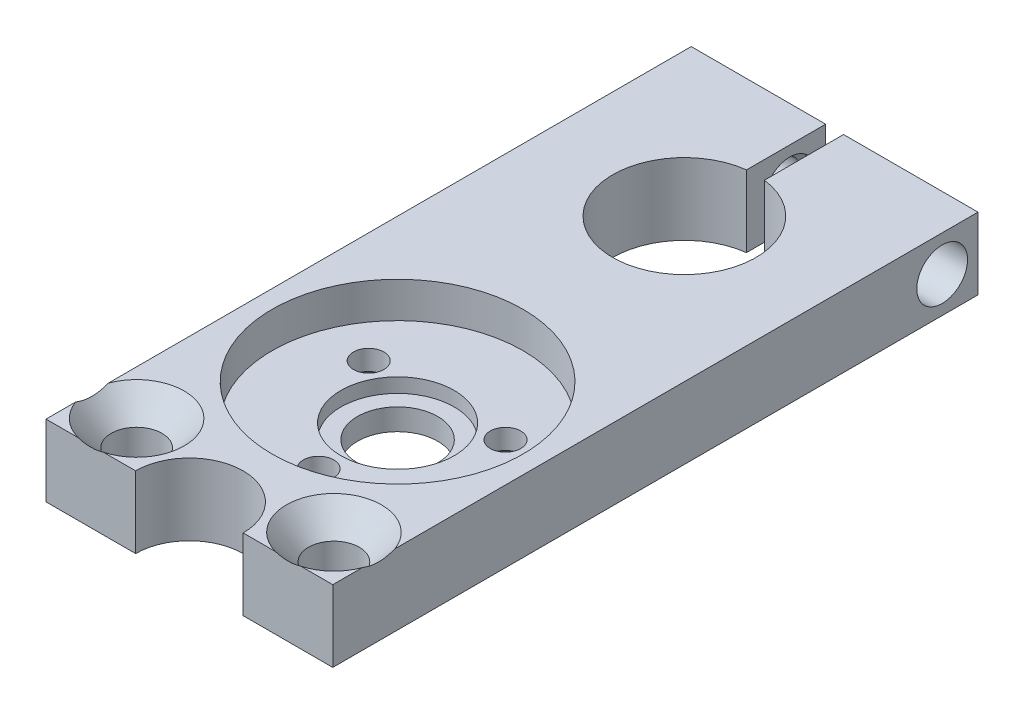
ISO-10303-21;
HEADER;
FILE_DESCRIPTION(('STEP AP214'),'2;1');
FILE_NAME('part.step','',(''),(''),'','','');
FILE_SCHEMA(('AUTOMOTIVE_DESIGN { 1 0 10303 214 1 1 1 1 }'));
ENDSEC;
DATA;
#1=APPLICATION_CONTEXT('core data for automotive mechanical design processes');
#2=APPLICATION_PROTOCOL_DEFINITION('international standard','automotive_design',2000,#1);
#3=PRODUCT_CONTEXT('',#1,'mechanical');
#4=PRODUCT('Part','Part','',(#3));
#5=PRODUCT_RELATED_PRODUCT_CATEGORY('part','',(#4));
#6=PRODUCT_DEFINITION_FORMATION('','',#4);
#7=PRODUCT_DEFINITION_CONTEXT('part definition',#1,'design');
#8=PRODUCT_DEFINITION('design','',#6,#7);
#9=PRODUCT_DEFINITION_SHAPE('','',#8);
#10=(LENGTH_UNIT() NAMED_UNIT(*) SI_UNIT(.MILLI.,.METRE.));
#11=(NAMED_UNIT(*) PLANE_ANGLE_UNIT() SI_UNIT($,.RADIAN.));
#12=(NAMED_UNIT(*) SI_UNIT($,.STERADIAN.) SOLID_ANGLE_UNIT());
#13=UNCERTAINTY_MEASURE_WITH_UNIT(LENGTH_MEASURE(1.E-05),#10,'distance_accuracy_value','');
#14=(GEOMETRIC_REPRESENTATION_CONTEXT(3) GLOBAL_UNCERTAINTY_ASSIGNED_CONTEXT((#13)) GLOBAL_UNIT_ASSIGNED_CONTEXT((#10,
#11,#12)) REPRESENTATION_CONTEXT('',''));
#15=CARTESIAN_POINT('',(0.,0.,0.));
#16=DIRECTION('',(0.,0.,1.));
#17=DIRECTION('',(1.,0.,0.));
#18=AXIS2_PLACEMENT_3D('',#15,#16,#17);
#19=CARTESIAN_POINT('',(12.7,3.17499999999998,0.));
#20=DIRECTION('',(0.,-1.,0.));
#21=DIRECTION('',(0.,0.,-1.));
#22=AXIS2_PLACEMENT_3D('',#19,#20,#21);
#23=PLANE('',#22);
#24=DIRECTION('',(-1.,0.,0.));
#25=VECTOR('',#24,1.);
#26=CARTESIAN_POINT('',(12.7,3.17499999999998,0.));
#27=LINE('',#26,#25);
#28=CARTESIAN_POINT('',(-9.8609578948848,3.17499999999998,0.));
#29=VERTEX_POINT('',#28);
#30=CARTESIAN_POINT('',(-12.7,3.17499999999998,0.));
#31=VERTEX_POINT('',#30);
#32=EDGE_CURVE('E157',#29,#31,#27,.T.);
#33=ORIENTED_EDGE('',*,*,#32,.F.);
#34=CARTESIAN_POINT('',(-8.7376,3.17499999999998,-4.064));
#35=DIRECTION('',(0.,1.,0.));
#36=DIRECTION('',(0.,0.,1.));
#37=AXIS2_PLACEMENT_3D('',#34,#35,#36);
#38=CIRCLE('',#37,4.2164);
#39=CARTESIAN_POINT('',(-12.7,3.17499999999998,-2.62267588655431));
#40=VERTEX_POINT('',#39);
#41=EDGE_CURVE('E137',#40,#29,#38,.T.);
#42=ORIENTED_EDGE('',*,*,#41,.F.);
#43=DIRECTION('',(0.,0.,1.));
#44=VECTOR('',#43,1.);
#45=CARTESIAN_POINT('',(-12.7,3.17499999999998,0.));
#46=LINE('',#45,#44);
#47=EDGE_CURVE('E251',#40,#31,#46,.T.);
#48=ORIENTED_EDGE('',*,*,#47,.T.);
#49=EDGE_LOOP('',(#33,#42,#48));
#50=FACE_BOUND('',#49,.T.);
#51=ADVANCED_FACE('F30',(#50),#23,.F.);
#52=DIRECTION('',(0.,0.,1.));
#53=VECTOR('',#52,1.);
#54=CARTESIAN_POINT('',(12.7,3.17499999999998,0.));
#55=LINE('',#54,#53);
#56=CARTESIAN_POINT('',(12.7,3.17499999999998,-2.62267588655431));
#57=VERTEX_POINT('',#56);
#58=CARTESIAN_POINT('',(12.7,3.17499999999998,0.));
#59=VERTEX_POINT('',#58);
#60=EDGE_CURVE('E277',#57,#59,#55,.T.);
#61=ORIENTED_EDGE('',*,*,#60,.F.);
#62=CARTESIAN_POINT('',(8.7376,3.17499999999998,-4.064));
#63=DIRECTION('',(0.,1.,0.));
#64=DIRECTION('',(0.,0.,1.));
#65=AXIS2_PLACEMENT_3D('',#62,#63,#64);
#66=CIRCLE('',#65,4.2164);
#67=CARTESIAN_POINT('',(9.8609578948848,3.17499999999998,0.));
#68=VERTEX_POINT('',#67);
#69=EDGE_CURVE('E58',#68,#57,#66,.T.);
#70=ORIENTED_EDGE('',*,*,#69,.F.);
#71=EDGE_CURVE('E159',#59,#68,#27,.T.);
#72=ORIENTED_EDGE('',*,*,#71,.F.);
#73=EDGE_LOOP('',(#61,#70,#72));
#74=FACE_BOUND('',#73,.T.);
#75=ADVANCED_FACE('F230',(#74),#23,.F.);
#76=CARTESIAN_POINT('',(-0.793750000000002,-3.17599999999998,-57.15));
#77=DIRECTION('',(-1.,0.,0.));
#78=DIRECTION('',(0.,0.,1.));
#79=AXIS2_PLACEMENT_3D('',#76,#77,#78);
#80=PLANE('',#79);
#81=CARTESIAN_POINT('',(-0.793750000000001,0.,-53.975));
#82=DIRECTION('',(-1.,0.,0.));
#83=DIRECTION('',(0.,0.,1.));
#84=AXIS2_PLACEMENT_3D('',#81,#82,#83);
#85=CIRCLE('',#84,2.24789999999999);
#86=CARTESIAN_POINT('',(-0.79375,0.,-51.7271));
#87=VERTEX_POINT('',#86);
#88=EDGE_CURVE('E204',#87,#87,#85,.T.);
#89=ORIENTED_EDGE('',*,*,#88,.T.);
#90=EDGE_LOOP('',(#89));
#91=FACE_BOUND('',#90,.T.);
#92=DIRECTION('',(0.,0.,-1.));
#93=VECTOR('',#92,1.);
#94=CARTESIAN_POINT('',(-0.793750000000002,-3.17499999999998,-57.15));
#95=LINE('',#94,#93);
#96=CARTESIAN_POINT('',(-0.793749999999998,-3.17499999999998,-50.1405953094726));
#97=VERTEX_POINT('',#96);
#98=CARTESIAN_POINT('',(-0.793750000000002,-3.17499999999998,-57.15));
#99=VERTEX_POINT('',#98);
#100=EDGE_CURVE('E320',#97,#99,#95,.T.);
#101=ORIENTED_EDGE('',*,*,#100,.T.);
#102=DIRECTION('',(0.,1.,0.));
#103=VECTOR('',#102,1.);
#104=CARTESIAN_POINT('',(-0.793750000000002,-3.17599999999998,-57.15));
#105=LINE('',#104,#103);
#106=CARTESIAN_POINT('',(-0.793750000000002,3.17500000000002,-57.15));
#107=VERTEX_POINT('',#106);
#108=EDGE_CURVE('E330',#99,#107,#105,.T.);
#109=ORIENTED_EDGE('',*,*,#108,.T.);
#110=DIRECTION('',(0.,0.,1.));
#111=VECTOR('',#110,1.);
#112=CARTESIAN_POINT('',(-0.793750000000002,3.17500000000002,-57.15));
#113=LINE('',#112,#111);
#114=CARTESIAN_POINT('',(-0.793749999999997,3.17500000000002,-50.1405953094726));
#115=VERTEX_POINT('',#114);
#116=EDGE_CURVE('E322',#107,#115,#113,.T.);
#117=ORIENTED_EDGE('',*,*,#116,.T.);
#118=DIRECTION('',(0.,1.,0.));
#119=VECTOR('',#118,1.);
#120=CARTESIAN_POINT('',(-0.793749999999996,-3.17599999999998,-50.1405953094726));
#121=LINE('',#120,#119);
#122=EDGE_CURVE('E329',#97,#115,#121,.T.);
#123=ORIENTED_EDGE('',*,*,#122,.F.);
#124=EDGE_LOOP('',(#101,#109,#117,#123));
#125=FACE_BOUND('',#124,.T.);
#126=ADVANCED_FACE('F247',(#91,#125),#80,.F.);
#127=CARTESIAN_POINT('',(12.7,3.17499999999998,0.));
#128=DIRECTION('',(0.,0.,-1.));
#129=DIRECTION('',(0.,1.,0.));
#130=AXIS2_PLACEMENT_3D('',#127,#128,#129);
#131=PLANE('',#130);
#132=CARTESIAN_POINT('',(-4.7625,3.17499999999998,0.));
#133=VERTEX_POINT('',#132);
#134=CARTESIAN_POINT('',(-7.6142421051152,3.17499999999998,0.));
#135=VERTEX_POINT('',#134);
#136=EDGE_CURVE('E148',#133,#135,#27,.T.);
#137=ORIENTED_EDGE('',*,*,#136,.T.);
#138=CARTESIAN_POINT('',(-15.8813891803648,7.77931474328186,0.));
#139=CARTESIAN_POINT('',(-15.7407143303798,7.63867013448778,0.));
#140=CARTESIAN_POINT('',(-15.5995443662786,7.49851705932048,0.));
#141=CARTESIAN_POINT('',(-15.3160099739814,7.2194071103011,0.));
#142=CARTESIAN_POINT('',(-15.1736454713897,7.08045031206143,0.));
#143=CARTESIAN_POINT('',(-14.8872217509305,6.80366068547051,0.));
#144=CARTESIAN_POINT('',(-14.7431595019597,6.66583098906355,0.));
#145=CARTESIAN_POINT('',(-14.4533959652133,6.3919094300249,0.));
#146=CARTESIAN_POINT('',(-14.3076947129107,6.2558175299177,0.));
#147=CARTESIAN_POINT('',(-14.0073747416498,5.97934643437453,0.));
#148=CARTESIAN_POINT('',(-13.8526609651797,5.83907026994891,0.));
#149=CARTESIAN_POINT('',(-13.5406339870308,5.56144139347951,0.));
#150=CARTESIAN_POINT('',(-13.383320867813,5.42408858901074,0.));
#151=CARTESIAN_POINT('',(-13.0656462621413,5.15323310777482,0.));
#152=CARTESIAN_POINT('',(-12.9052876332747,5.01972709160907,0.));
#153=CARTESIAN_POINT('',(-12.5806540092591,4.75758260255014,0.));
#154=CARTESIAN_POINT('',(-12.416379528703,4.62894349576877,0.));
#155=CARTESIAN_POINT('',(-12.0839923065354,4.37892531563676,0.));
#156=CARTESIAN_POINT('',(-11.9159105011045,4.25750538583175,0.));
#157=CARTESIAN_POINT('',(-11.5736207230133,4.02328424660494,0.));
#158=CARTESIAN_POINT('',(-11.3994089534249,3.91048852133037,0.));
#159=CARTESIAN_POINT('',(-11.0457411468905,3.69830836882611,0.));
#160=CARTESIAN_POINT('',(-10.8663724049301,3.59878007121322,0.));
#161=CARTESIAN_POINT('',(-10.4993774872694,3.41653152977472,0.));
#162=CARTESIAN_POINT('',(-10.311765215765,3.33378421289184,0.));
#163=CARTESIAN_POINT('',(-10.0333064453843,3.23064157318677,0.));
#164=CARTESIAN_POINT('',(-9.94588202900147,3.20095512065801,0.));
#165=CARTESIAN_POINT('',(-9.76916762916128,3.14694347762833,0.));
#166=CARTESIAN_POINT('',(-9.6798739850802,3.12263014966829,0.));
#167=CARTESIAN_POINT('',(-9.48608671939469,3.07687907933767,0.));
#168=CARTESIAN_POINT('',(-9.38135214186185,3.05644564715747,0.));
#169=CARTESIAN_POINT('',(-9.17048408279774,3.02459320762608,0.));
#170=CARTESIAN_POINT('',(-9.06435033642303,3.01317593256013,0.));
#171=CARTESIAN_POINT('',(-8.85159314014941,2.99992827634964,0.));
#172=CARTESIAN_POINT('',(-8.74497034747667,2.99808749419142,0.));
#173=CARTESIAN_POINT('',(-8.53200431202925,3.00406042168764,0.));
#174=CARTESIAN_POINT('',(-8.42566105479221,3.01187362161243,0.));
#175=CARTESIAN_POINT('',(-8.2180079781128,3.03629624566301,0.));
#176=CARTESIAN_POINT('',(-8.11665781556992,3.05256849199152,0.));
#177=CARTESIAN_POINT('',(-7.91554050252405,3.09300838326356,0.));
#178=CARTESIAN_POINT('',(-7.81577369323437,3.11717770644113,0.));
#179=CARTESIAN_POINT('',(-7.61807080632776,3.17257127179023,0.));
#180=CARTESIAN_POINT('',(-7.5201378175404,3.20380642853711,0.));
#181=CARTESIAN_POINT('',(-7.32644874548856,3.27236786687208,0.));
#182=CARTESIAN_POINT('',(-7.23069267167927,3.30969417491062,0.));
#183=CARTESIAN_POINT('',(-7.01094785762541,3.40237467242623,0.));
#184=CARTESIAN_POINT('',(-6.88777891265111,3.45966686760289,0.));
#185=CARTESIAN_POINT('',(-6.64506425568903,3.58151473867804,0.));
#186=CARTESIAN_POINT('',(-6.52552021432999,3.64607370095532,0.));
#187=CARTESIAN_POINT('',(-6.2895649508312,3.7810788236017,0.));
#188=CARTESIAN_POINT('',(-6.17315920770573,3.85153449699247,0.));
#189=CARTESIAN_POINT('',(-5.94328473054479,3.99709120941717,0.));
#190=CARTESIAN_POINT('',(-5.8298164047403,4.07219288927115,0.));
#191=CARTESIAN_POINT('',(-5.60373389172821,4.22731697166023,0.));
#192=CARTESIAN_POINT('',(-5.49115956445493,4.30739721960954,0.));
#193=CARTESIAN_POINT('',(-5.26830815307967,4.47068820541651,0.));
#194=CARTESIAN_POINT('',(-5.15803113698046,4.55389903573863,0.));
#195=CARTESIAN_POINT('',(-4.93958493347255,4.72279488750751,0.));
#196=CARTESIAN_POINT('',(-4.83141358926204,4.8084771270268,0.));
#197=CARTESIAN_POINT('',(-4.61679595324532,4.9819602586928,0.));
#198=CARTESIAN_POINT('',(-4.51034958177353,5.0697610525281,0.));
#199=CARTESIAN_POINT('',(-4.26863770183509,5.27256898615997,0.));
#200=CARTESIAN_POINT('',(-4.13386090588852,5.38815808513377,0.));
#201=CARTESIAN_POINT('',(-3.86637658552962,5.62170954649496,0.));
#202=CARTESIAN_POINT('',(-3.7336691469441,5.73967200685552,0.));
#203=CARTESIAN_POINT('',(-3.33811276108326,6.09648440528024,0.));
#204=CARTESIAN_POINT('',(-3.07787110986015,6.33822418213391,0.));
#205=CARTESIAN_POINT('',(-2.56229374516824,6.82714857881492,0.));
#206=CARTESIAN_POINT('',(-2.30696106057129,7.07433637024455,0.));
#207=CARTESIAN_POINT('',(-1.80008065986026,7.57257178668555,0.));
#208=CARTESIAN_POINT('',(-1.54853306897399,7.82361953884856,0.));
#209=CARTESIAN_POINT('',(-1.047672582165,8.32926412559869,0.));
#210=CARTESIAN_POINT('',(-0.798367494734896,8.58386867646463,0.));
#211=CARTESIAN_POINT('',(-0.302036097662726,9.09529583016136,0.));
#212=CARTESIAN_POINT('',(-0.0550098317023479,9.35211847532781,0.));
#213=CARTESIAN_POINT('',(0.437132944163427,9.86739943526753,0.));
#214=CARTESIAN_POINT('',(0.682250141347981,10.1258570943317,0.));
#215=CARTESIAN_POINT('',(1.1710156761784,10.6441573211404,0.));
#216=CARTESIAN_POINT('',(1.41466401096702,10.903999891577,0.));
#217=CARTESIAN_POINT('',(2.0783756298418,11.6150941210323,0.));
#218=CARTESIAN_POINT('',(2.49724438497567,12.0674604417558,0.));
#219=CARTESIAN_POINT('',(3.33242050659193,12.9746395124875,0.));
#220=CARTESIAN_POINT('',(3.74872758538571,13.4294525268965,0.));
#221=CARTESIAN_POINT('',(4.57741068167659,14.338694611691,0.));
#222=CARTESIAN_POINT('',(4.98979597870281,14.7931152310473,0.));
#223=CARTESIAN_POINT('',(5.81299526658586,15.7032742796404,0.));
#224=CARTESIAN_POINT('',(6.22380944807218,16.1590125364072,0.));
#225=CARTESIAN_POINT('',(6.63407323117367,16.615242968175,0.));
#226=B_SPLINE_CURVE_WITH_KNOTS('',3,(#138,#139,#140,#141,#142,#143,#144,#145,#146,#147,#148,
#149,#150,#151,#152,#153,#154,#155,#156,#157,#158,#159,#160,#161,#162,#163,#164,#165,#166,#167,
#168,#169,#170,#171,#172,#173,#174,#175,#176,#177,#178,#179,#180,#181,#182,#183,#184,#185,#186,
#187,#188,#189,#190,#191,#192,#193,#194,#195,#196,#197,#198,#199,#200,#201,#202,#203,#204,#205,
#206,#207,#208,#209,#210,#211,#212,#213,#214,#215,#216,#217,#218,#219,#220,#221,#222,#223,#224,
#225),.UNSPECIFIED.,.F.,.F.,(4,2,2,2,2,2,2,2,2,2,2,2,2,2,2,2,2,2,2,2,2,2,2,2,2,2,2,2,2,2,2,2,2,
2,2,2,2,2,2,2,2,2,2,4),(0.,0.596771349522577,1.19358014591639,1.79169733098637,2.38980159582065,
3.01628950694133,3.64275758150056,4.26866434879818,4.89448931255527,5.51634670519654,
6.13859630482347,6.7534266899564,7.36725712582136,7.64409484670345,7.92153778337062,
8.24130011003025,8.56112385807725,8.88060017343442,9.20005962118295,9.50766427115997,
9.8153343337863,10.1234829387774,10.4316328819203,10.8388441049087,11.2462402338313,
11.6543067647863,12.0624297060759,12.4768185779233,12.8912196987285,13.3051712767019,
13.7191036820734,14.2517310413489,14.7843804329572,15.8498420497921,16.9159412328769,
17.9820756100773,19.0510710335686,20.120086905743,21.1886982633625,22.2573116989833,
24.1068300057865,25.9565523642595,27.7974824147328,29.6381815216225),.UNSPECIFIED.);
#227=EDGE_CURVE('E134',#135,#29,#226,.F.);
#228=ORIENTED_EDGE('',*,*,#227,.T.);
#229=ORIENTED_EDGE('',*,*,#32,.T.);
#230=DIRECTION('',(0.,-1.,0.));
#231=VECTOR('',#230,1.);
#232=CARTESIAN_POINT('',(-12.7,3.17499999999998,0.));
#233=LINE('',#232,#231);
#234=CARTESIAN_POINT('',(-12.7,-3.17499999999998,0.));
#235=VERTEX_POINT('',#234);
#236=EDGE_CURVE('E254',#31,#235,#233,.T.);
#237=ORIENTED_EDGE('',*,*,#236,.T.);
#238=DIRECTION('',(-1.,0.,0.));
#239=VECTOR('',#238,1.);
#240=CARTESIAN_POINT('',(12.7,-3.17499999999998,0.));
#241=LINE('',#240,#239);
#242=CARTESIAN_POINT('',(-4.7625,-3.17499999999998,0.));
#243=VERTEX_POINT('',#242);
#244=EDGE_CURVE('E179',#243,#235,#241,.T.);
#245=ORIENTED_EDGE('',*,*,#244,.F.);
#246=DIRECTION('',(0.,1.,0.));
#247=VECTOR('',#246,1.);
#248=CARTESIAN_POINT('',(-4.7625,-3.17600000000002,0.));
#249=LINE('',#248,#247);
#250=EDGE_CURVE('E155',#133,#243,#249,.F.);
#251=ORIENTED_EDGE('',*,*,#250,.F.);
#252=EDGE_LOOP('',(#137,#228,#229,#237,#245,#251));
#253=FACE_BOUND('',#252,.T.);
#254=ADVANCED_FACE('F153',(#253),#131,.F.);
#255=CARTESIAN_POINT('',(12.7,3.17500000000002,-57.15));
#256=DIRECTION('',(0.,0.,1.));
#257=DIRECTION('',(1.,0.,0.));
#258=AXIS2_PLACEMENT_3D('',#255,#256,#257);
#259=PLANE('',#258);
#260=DIRECTION('',(-1.,0.,0.));
#261=VECTOR('',#260,1.);
#262=CARTESIAN_POINT('',(12.7,3.17500000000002,-57.15));
#263=LINE('',#262,#261);
#264=CARTESIAN_POINT('',(-12.7,3.17500000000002,-57.15));
#265=VERTEX_POINT('',#264);
#266=EDGE_CURVE('E164',#107,#265,#263,.T.);
#267=ORIENTED_EDGE('',*,*,#266,.F.);
#268=ORIENTED_EDGE('',*,*,#108,.F.);
#269=DIRECTION('',(-1.,0.,0.));
#270=VECTOR('',#269,1.);
#271=CARTESIAN_POINT('',(12.7,-3.17499999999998,-57.15));
#272=LINE('',#271,#270);
#273=CARTESIAN_POINT('',(-12.7,-3.17499999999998,-57.15));
#274=VERTEX_POINT('',#273);
#275=EDGE_CURVE('E174',#99,#274,#272,.T.);
#276=ORIENTED_EDGE('',*,*,#275,.T.);
#277=DIRECTION('',(0.,1.,0.));
#278=VECTOR('',#277,1.);
#279=CARTESIAN_POINT('',(-12.7,3.17500000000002,-57.15));
#280=LINE('',#279,#278);
#281=EDGE_CURVE('E261',#274,#265,#280,.T.);
#282=ORIENTED_EDGE('',*,*,#281,.T.);
#283=EDGE_LOOP('',(#267,#268,#276,#282));
#284=FACE_BOUND('',#283,.T.);
#285=ADVANCED_FACE('F234',(#284),#259,.F.);
#286=ORIENTED_EDGE('',*,*,#71,.T.);
#287=CARTESIAN_POINT('',(1.53090627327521,7.84227981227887,0.));
#288=CARTESIAN_POINT('',(1.67317844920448,7.69973501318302,0.));
#289=CARTESIAN_POINT('',(1.81594689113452,7.55768185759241,0.));
#290=CARTESIAN_POINT('',(2.10268250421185,7.27477322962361,0.));
#291=CARTESIAN_POINT('',(2.24664974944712,7.13391783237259,0.));
#292=CARTESIAN_POINT('',(2.53628897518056,6.85332936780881,0.));
#293=CARTESIAN_POINT('',(2.68196400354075,6.71359944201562,0.));
#294=CARTESIAN_POINT('',(2.97496225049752,6.43588254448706,0.));
#295=CARTESIAN_POINT('',(3.12228543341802,6.29789553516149,0.));
#296=CARTESIAN_POINT('',(3.42600586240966,6.01749207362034,0.));
#297=CARTESIAN_POINT('',(3.58249973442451,5.87518005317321,0.));
#298=CARTESIAN_POINT('',(3.89811115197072,5.59349768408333,0.));
#299=CARTESIAN_POINT('',(4.05722861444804,5.45412724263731,0.));
#300=CARTESIAN_POINT('',(4.37854539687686,5.17926841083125,0.));
#301=CARTESIAN_POINT('',(4.54074181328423,5.04377663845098,0.));
#302=CARTESIAN_POINT('',(4.86910360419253,4.77770910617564,0.));
#303=CARTESIAN_POINT('',(5.03526845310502,4.6471327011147,0.));
#304=CARTESIAN_POINT('',(5.37064796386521,4.39397827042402,0.));
#305=CARTESIAN_POINT('',(5.53980620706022,4.27132599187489,0.));
#306=CARTESIAN_POINT('',(5.88429728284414,4.03467023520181,0.));
#307=CARTESIAN_POINT('',(6.05963399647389,3.92067234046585,0.));
#308=CARTESIAN_POINT('',(6.41559910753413,3.70617743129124,0.));
#309=CARTESIAN_POINT('',(6.59613882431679,3.60553489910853,0.));
#310=CARTESIAN_POINT('',(6.9655817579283,3.42119238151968,0.));
#311=CARTESIAN_POINT('',(7.15447073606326,3.33746481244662,0.));
#312=CARTESIAN_POINT('',(7.43382326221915,3.23348064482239,0.));
#313=CARTESIAN_POINT('',(7.52078870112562,3.2037724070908,0.));
#314=CARTESIAN_POINT('',(7.69657477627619,3.14964379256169,0.));
#315=CARTESIAN_POINT('',(7.78539907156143,3.12523518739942,0.));
#316=CARTESIAN_POINT('',(7.97870206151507,3.07906552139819,0.));
#317=CARTESIAN_POINT('',(8.08343130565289,3.05833663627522,0.));
#318=CARTESIAN_POINT('',(8.29431225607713,3.02587716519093,0.));
#319=CARTESIAN_POINT('',(8.40046423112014,3.0141483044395,0.));
#320=CARTESIAN_POINT('',(8.61328298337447,3.00027604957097,0.));
#321=CARTESIAN_POINT('',(8.71994905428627,2.99812197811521,0.));
#322=CARTESIAN_POINT('',(8.93302937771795,3.00348202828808,0.));
#323=CARTESIAN_POINT('',(9.03944364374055,3.01099561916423,0.));
#324=CARTESIAN_POINT('',(9.24731572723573,3.03486386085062,0.));
#325=CARTESIAN_POINT('',(9.34881248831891,3.05088514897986,0.));
#326=CARTESIAN_POINT('',(9.55023514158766,3.09086490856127,0.));
#327=CARTESIAN_POINT('',(9.65016069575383,3.11482506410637,0.));
#328=CARTESIAN_POINT('',(9.84818759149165,3.16984341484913,0.));
#329=CARTESIAN_POINT('',(9.9462858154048,3.20091271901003,0.));
#330=CARTESIAN_POINT('',(10.1403041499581,3.26918289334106,0.));
#331=CARTESIAN_POINT('',(10.236224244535,3.30638380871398,0.));
#332=CARTESIAN_POINT('',(10.4553973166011,3.39841704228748,0.));
#333=CARTESIAN_POINT('',(10.5778573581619,3.45513189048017,0.));
#334=CARTESIAN_POINT('',(10.8191934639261,3.57577676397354,0.));
#335=CARTESIAN_POINT('',(10.9380678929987,3.63971001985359,0.));
#336=CARTESIAN_POINT('',(11.1727115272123,3.77343166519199,0.));
#337=CARTESIAN_POINT('',(11.2884753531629,3.84322943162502,0.));
#338=CARTESIAN_POINT('',(11.5170886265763,3.98745165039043,0.));
#339=CARTESIAN_POINT('',(11.6299376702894,4.06187673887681,0.));
#340=CARTESIAN_POINT('',(11.8547899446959,4.21562672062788,0.));
#341=CARTESIAN_POINT('',(11.9667535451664,4.29500932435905,0.));
#342=CARTESIAN_POINT('',(12.1883956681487,4.45689828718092,0.));
#343=CARTESIAN_POINT('',(12.2980741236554,4.53940473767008,0.));
#344=CARTESIAN_POINT('',(12.5153336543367,4.70688973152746,0.));
#345=CARTESIAN_POINT('',(12.6229168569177,4.79186552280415,0.));
#346=CARTESIAN_POINT('',(12.836364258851,4.96393394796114,0.));
#347=CARTESIAN_POINT('',(12.9422285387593,5.05102648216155,0.));
#348=CARTESIAN_POINT('',(13.1836028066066,5.25304135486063,0.));
#349=CARTESIAN_POINT('',(13.3186074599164,5.36856698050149,0.));
#350=CARTESIAN_POINT('',(13.5865243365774,5.60202296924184,0.));
#351=CARTESIAN_POINT('',(13.7194364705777,5.71995343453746,0.));
#352=CARTESIAN_POINT('',(14.1155802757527,6.07670635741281,0.));
#353=CARTESIAN_POINT('',(14.3761768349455,6.31845426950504,0.));
#354=CARTESIAN_POINT('',(14.8924188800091,6.80745526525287,0.));
#355=CARTESIAN_POINT('',(15.1480612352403,7.05471163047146,0.));
#356=CARTESIAN_POINT('',(15.6555277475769,7.55312136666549,0.));
#357=CARTESIAN_POINT('',(15.9073517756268,7.80427486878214,0.));
#358=CARTESIAN_POINT('',(16.4087535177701,8.31016711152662,0.));
#359=CARTESIAN_POINT('',(16.6583232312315,8.56491376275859,0.));
#360=CARTESIAN_POINT('',(17.1551670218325,9.07664268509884,0.));
#361=CARTESIAN_POINT('',(17.4024410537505,9.33362500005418,0.));
#362=CARTESIAN_POINT('',(17.8950646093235,9.84923536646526,0.));
#363=CARTESIAN_POINT('',(18.1404148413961,10.1078627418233,0.));
#364=CARTESIAN_POINT('',(18.629637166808,10.6265115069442,0.));
#365=CARTESIAN_POINT('',(18.8735092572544,10.8865328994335,0.));
#366=CARTESIAN_POINT('',(19.5372289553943,11.5974891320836,0.));
#367=CARTESIAN_POINT('',(19.9558801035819,12.0495406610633,0.));
#368=CARTESIAN_POINT('',(20.7906147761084,12.9560983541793,0.));
#369=CARTESIAN_POINT('',(21.2066980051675,13.4106047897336,0.));
#370=CARTESIAN_POINT('',(22.0348971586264,14.319204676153,0.));
#371=CARTESIAN_POINT('',(22.4470225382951,14.773289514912,0.));
#372=CARTESIAN_POINT('',(23.2696973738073,15.6827791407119,0.));
#373=CARTESIAN_POINT('',(23.680247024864,16.1381837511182,0.));
#374=CARTESIAN_POINT('',(24.090245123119,16.5940815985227,0.));
#375=B_SPLINE_CURVE_WITH_KNOTS('',3,(#287,#288,#289,#290,#291,#292,#293,#294,#295,#296,#297,
#298,#299,#300,#301,#302,#303,#304,#305,#306,#307,#308,#309,#310,#311,#312,#313,#314,#315,#316,
#317,#318,#319,#320,#321,#322,#323,#324,#325,#326,#327,#328,#329,#330,#331,#332,#333,#334,#335,
#336,#337,#338,#339,#340,#341,#342,#343,#344,#345,#346,#347,#348,#349,#350,#351,#352,#353,#354,
#355,#356,#357,#358,#359,#360,#361,#362,#363,#364,#365,#366,#367,#368,#369,#370,#371,#372,#373,
#374),.UNSPECIFIED.,.F.,.F.,(4,2,2,2,2,2,2,2,2,2,2,2,2,2,2,2,2,2,2,2,2,2,2,2,2,2,2,2,2,2,2,2,2,
2,2,2,2,2,2,2,2,2,2,4),(0.,0.604190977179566,1.2084195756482,1.81397423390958,2.41951580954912,
3.05406305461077,3.68859025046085,4.32254618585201,4.95641861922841,5.58305971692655,
6.21010171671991,6.8296237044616,7.44812711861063,7.72368560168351,7.99985003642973,
8.31976900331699,8.63974927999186,8.95937264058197,9.27897845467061,9.58689639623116,
9.89487969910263,10.2033475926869,10.511817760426,10.9163743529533,11.3211127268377,
11.7265110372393,12.1319652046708,12.5436484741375,12.9553437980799,13.3665966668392,
13.7778302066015,14.3108518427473,14.8438961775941,15.91015204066,16.9770610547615,
18.0440060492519,19.1138612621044,20.1837375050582,21.2531992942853,22.3226631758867,
24.1710449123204,26.0196353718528,27.8592954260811,29.6987196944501),.UNSPECIFIED.);
#376=CARTESIAN_POINT('',(7.6142421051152,3.17499999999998,0.));
#377=VERTEX_POINT('',#376);
#378=EDGE_CURVE('E290',#68,#377,#375,.F.);
#379=ORIENTED_EDGE('',*,*,#378,.T.);
#380=CARTESIAN_POINT('',(4.7625,3.17499999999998,0.));
#381=VERTEX_POINT('',#380);
#382=EDGE_CURVE('E156',#377,#381,#27,.T.);
#383=ORIENTED_EDGE('',*,*,#382,.T.);
#384=DIRECTION('',(0.,1.,0.));
#385=VECTOR('',#384,1.);
#386=CARTESIAN_POINT('',(4.7625,-3.17600000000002,0.));
#387=LINE('',#386,#385);
#388=CARTESIAN_POINT('',(4.7625,-3.17499999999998,0.));
#389=VERTEX_POINT('',#388);
#390=EDGE_CURVE('E309',#389,#381,#387,.T.);
#391=ORIENTED_EDGE('',*,*,#390,.F.);
#392=CARTESIAN_POINT('',(12.7,-3.17499999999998,0.));
#393=VERTEX_POINT('',#392);
#394=EDGE_CURVE('E180',#393,#389,#241,.T.);
#395=ORIENTED_EDGE('',*,*,#394,.F.);
#396=DIRECTION('',(0.,-1.,0.));
#397=VECTOR('',#396,1.);
#398=CARTESIAN_POINT('',(12.7,3.17499999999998,0.));
#399=LINE('',#398,#397);
#400=EDGE_CURVE('E269',#59,#393,#399,.T.);
#401=ORIENTED_EDGE('',*,*,#400,.F.);
#402=EDGE_LOOP('',(#286,#379,#383,#391,#395,#401));
#403=FACE_BOUND('',#402,.T.);
#404=ADVANCED_FACE('F32',(#403),#131,.F.);
#405=CARTESIAN_POINT('',(12.7,-3.17499999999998,0.));
#406=DIRECTION('',(0.,1.,0.));
#407=DIRECTION('',(0.,0.,1.));
#408=AXIS2_PLACEMENT_3D('',#405,#406,#407);
#409=PLANE('',#408);
#410=CARTESIAN_POINT('',(-8.7376,-3.17500000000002,-4.064));
#411=DIRECTION('',(0.,1.,0.));
#412=DIRECTION('',(0.,0.,1.));
#413=AXIS2_PLACEMENT_3D('',#410,#411,#412);
#414=CIRCLE('',#413,2.2479);
#415=CARTESIAN_POINT('',(-8.7376,-3.17500000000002,-1.8161));
#416=VERTEX_POINT('',#415);
#417=EDGE_CURVE('E693',#416,#416,#414,.T.);
#418=ORIENTED_EDGE('',*,*,#417,.T.);
#419=EDGE_LOOP('',(#418));
#420=FACE_BOUND('',#419,.T.);
#421=CARTESIAN_POINT('',(8.7376,-3.17500000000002,-4.064));
#422=DIRECTION('',(0.,1.,0.));
#423=DIRECTION('',(0.,0.,1.));
#424=AXIS2_PLACEMENT_3D('',#421,#422,#423);
#425=CIRCLE('',#424,2.2479);
#426=CARTESIAN_POINT('',(8.7376,-3.17500000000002,-1.8161));
#427=VERTEX_POINT('',#426);
#428=EDGE_CURVE('E141',#427,#427,#425,.T.);
#429=ORIENTED_EDGE('',*,*,#428,.T.);
#430=EDGE_LOOP('',(#429));
#431=FACE_BOUND('',#430,.T.);
#432=ORIENTED_EDGE('',*,*,#394,.T.);
#433=CARTESIAN_POINT('',(0.,-3.17499999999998,0.));
#434=DIRECTION('',(0.,1.,0.));
#435=DIRECTION('',(0.,0.,1.));
#436=AXIS2_PLACEMENT_3D('',#433,#434,#435);
#437=CIRCLE('',#436,4.7625);
#438=EDGE_CURVE('E315',#243,#389,#437,.F.);
#439=ORIENTED_EDGE('',*,*,#438,.F.);
#440=ORIENTED_EDGE('',*,*,#244,.T.);
#441=DIRECTION('',(0.,0.,-1.));
#442=VECTOR('',#441,1.);
#443=CARTESIAN_POINT('',(-12.7,-3.17499999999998,0.));
#444=LINE('',#443,#442);
#445=EDGE_CURVE('E257',#235,#274,#444,.T.);
#446=ORIENTED_EDGE('',*,*,#445,.T.);
#447=ORIENTED_EDGE('',*,*,#275,.F.);
#448=ORIENTED_EDGE('',*,*,#100,.F.);
#449=CARTESIAN_POINT('',(0.,-3.17499999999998,-43.8404));
#450=DIRECTION('',(0.,1.,0.));
#451=DIRECTION('',(0.,0.,1.));
#452=AXIS2_PLACEMENT_3D('',#449,#450,#451);
#453=CIRCLE('',#452,6.35);
#454=CARTESIAN_POINT('',(0.793749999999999,-3.17499999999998,-50.1405953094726));
#455=VERTEX_POINT('',#454);
#456=EDGE_CURVE('E332',#455,#97,#453,.F.);
#457=ORIENTED_EDGE('',*,*,#456,.F.);
#458=DIRECTION('',(0.,0.,1.));
#459=VECTOR('',#458,1.);
#460=CARTESIAN_POINT('',(0.793749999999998,-3.17499999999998,-57.15));
#461=LINE('',#460,#459);
#462=CARTESIAN_POINT('',(0.793749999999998,-3.17499999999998,-57.15));
#463=VERTEX_POINT('',#462);
#464=EDGE_CURVE('E317',#463,#455,#461,.T.);
#465=ORIENTED_EDGE('',*,*,#464,.F.);
#466=CARTESIAN_POINT('',(12.7,-3.17499999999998,-57.15));
#467=VERTEX_POINT('',#466);
#468=EDGE_CURVE('E176',#467,#463,#272,.T.);
#469=ORIENTED_EDGE('',*,*,#468,.F.);
#470=DIRECTION('',(0.,0.,-1.));
#471=VECTOR('',#470,1.);
#472=CARTESIAN_POINT('',(12.7,-3.17499999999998,0.));
#473=LINE('',#472,#471);
#474=EDGE_CURVE('E271',#393,#467,#473,.T.);
#475=ORIENTED_EDGE('',*,*,#474,.F.);
#476=EDGE_LOOP('',(#432,#439,#440,#446,#447,#448,#457,#465,#469,#475));
#477=FACE_BOUND('',#476,.T.);
#478=CARTESIAN_POINT('',(6.06018596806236,-3.17499999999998,-21.93925));
#479=DIRECTION('',(0.,-1.,0.));
#480=DIRECTION('',(0.,0.,-1.));
#481=AXIS2_PLACEMENT_3D('',#478,#479,#480);
#482=CIRCLE('',#481,2.75);
#483=CARTESIAN_POINT('',(6.06018596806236,-3.17499999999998,-24.68925));
#484=VERTEX_POINT('',#483);
#485=EDGE_CURVE('E197',#484,#484,#482,.T.);
#486=ORIENTED_EDGE('',*,*,#485,.F.);
#487=EDGE_LOOP('',(#486));
#488=FACE_BOUND('',#487,.T.);
#489=CARTESIAN_POINT('',(-6.0601859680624,-3.17499999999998,-21.9392499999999));
#490=DIRECTION('',(0.,-1.,0.));
#491=DIRECTION('',(0.,0.,-1.));
#492=AXIS2_PLACEMENT_3D('',#489,#490,#491);
#493=CIRCLE('',#492,2.75);
#494=CARTESIAN_POINT('',(-6.0601859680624,-3.17499999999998,-24.6892499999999));
#495=VERTEX_POINT('',#494);
#496=EDGE_CURVE('E192',#495,#495,#493,.T.);
#497=ORIENTED_EDGE('',*,*,#496,.F.);
#498=EDGE_LOOP('',(#497));
#499=FACE_BOUND('',#498,.T.);
#500=CARTESIAN_POINT('',(0.,-3.17499999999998,-11.4427));
#501=DIRECTION('',(0.,-1.,0.));
#502=DIRECTION('',(0.,0.,-1.));
#503=AXIS2_PLACEMENT_3D('',#500,#501,#502);
#504=CIRCLE('',#503,2.75);
#505=CARTESIAN_POINT('',(0.,-3.17499999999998,-14.1927));
#506=VERTEX_POINT('',#505);
#507=EDGE_CURVE('E187',#506,#506,#504,.T.);
#508=ORIENTED_EDGE('',*,*,#507,.F.);
#509=EDGE_LOOP('',(#508));
#510=FACE_BOUND('',#509,.T.);
#511=CARTESIAN_POINT('',(0.,-3.17499999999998,-18.4404));
#512=DIRECTION('',(0.,1.,0.));
#513=DIRECTION('',(0.,0.,1.));
#514=AXIS2_PLACEMENT_3D('',#511,#512,#513);
#515=CIRCLE('',#514,3.556);
#516=CARTESIAN_POINT('',(0.,-3.17499999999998,-14.8844));
#517=VERTEX_POINT('',#516);
#518=EDGE_CURVE('E357',#517,#517,#515,.F.);
#519=ORIENTED_EDGE('',*,*,#518,.F.);
#520=EDGE_LOOP('',(#519));
#521=FACE_BOUND('',#520,.T.);
#522=ADVANCED_FACE('F232',(#420,#431,#477,#488,#499,#510,#521),#409,.F.);
#523=ORIENTED_EDGE('',*,*,#468,.T.);
#524=DIRECTION('',(0.,1.,0.));
#525=VECTOR('',#524,1.);
#526=CARTESIAN_POINT('',(0.793749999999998,-3.17599999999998,-57.15));
#527=LINE('',#526,#525);
#528=CARTESIAN_POINT('',(0.793749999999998,3.17500000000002,-57.15));
#529=VERTEX_POINT('',#528);
#530=EDGE_CURVE('E333',#463,#529,#527,.T.);
#531=ORIENTED_EDGE('',*,*,#530,.T.);
#532=CARTESIAN_POINT('',(12.7,3.17500000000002,-57.15));
#533=VERTEX_POINT('',#532);
#534=EDGE_CURVE('E169',#533,#529,#263,.T.);
#535=ORIENTED_EDGE('',*,*,#534,.F.);
#536=DIRECTION('',(0.,1.,0.));
#537=VECTOR('',#536,1.);
#538=CARTESIAN_POINT('',(12.7,3.17500000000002,-57.15));
#539=LINE('',#538,#537);
#540=EDGE_CURVE('E274',#467,#533,#539,.T.);
#541=ORIENTED_EDGE('',*,*,#540,.F.);
#542=EDGE_LOOP('',(#523,#531,#535,#541));
#543=FACE_BOUND('',#542,.T.);
#544=ADVANCED_FACE('F228',(#543),#259,.F.);
#545=CARTESIAN_POINT('',(0.,3.17499999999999,-18.4404));
#546=DIRECTION('',(0.,1.,0.));
#547=DIRECTION('',(0.,0.,1.));
#548=AXIS2_PLACEMENT_3D('',#545,#546,#547);
#549=CIRCLE('',#548,11.1125);
#550=CARTESIAN_POINT('',(0.,3.17499999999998,-7.3279));
#551=VERTEX_POINT('',#550);
#552=EDGE_CURVE('E264',#551,#551,#549,.T.);
#553=ORIENTED_EDGE('',*,*,#552,.F.);
#554=EDGE_LOOP('',(#553));
#555=FACE_BOUND('',#554,.T.);
#556=CARTESIAN_POINT('',(-12.7,3.17499999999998,-5.50532411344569));
#557=VERTEX_POINT('',#556);
#558=EDGE_CURVE('E150',#265,#557,#46,.T.);
#559=ORIENTED_EDGE('',*,*,#558,.T.);
#560=EDGE_CURVE('E51',#135,#557,#38,.T.);
#561=ORIENTED_EDGE('',*,*,#560,.F.);
#562=ORIENTED_EDGE('',*,*,#136,.F.);
#563=CARTESIAN_POINT('',(0.,3.17499999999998,0.));
#564=DIRECTION('',(0.,1.,0.));
#565=DIRECTION('',(0.,0.,1.));
#566=AXIS2_PLACEMENT_3D('',#563,#564,#565);
#567=CIRCLE('',#566,4.7625);
#568=EDGE_CURVE('E313',#381,#133,#567,.T.);
#569=ORIENTED_EDGE('',*,*,#568,.F.);
#570=ORIENTED_EDGE('',*,*,#382,.F.);
#571=CARTESIAN_POINT('',(12.7,3.17499999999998,-5.50532411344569));
#572=VERTEX_POINT('',#571);
#573=EDGE_CURVE('E287',#572,#377,#66,.T.);
#574=ORIENTED_EDGE('',*,*,#573,.F.);
#575=EDGE_CURVE('E160',#533,#572,#55,.T.);
#576=ORIENTED_EDGE('',*,*,#575,.F.);
#577=ORIENTED_EDGE('',*,*,#534,.T.);
#578=DIRECTION('',(0.,0.,-1.));
#579=VECTOR('',#578,1.);
#580=CARTESIAN_POINT('',(0.793749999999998,3.17500000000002,-57.15));
#581=LINE('',#580,#579);
#582=CARTESIAN_POINT('',(0.793749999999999,3.17500000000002,-50.1405953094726));
#583=VERTEX_POINT('',#582);
#584=EDGE_CURVE('E327',#583,#529,#581,.T.);
#585=ORIENTED_EDGE('',*,*,#584,.F.);
#586=CARTESIAN_POINT('',(0.,3.17500000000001,-43.8404));
#587=DIRECTION('',(0.,1.,0.));
#588=DIRECTION('',(0.,0.,1.));
#589=AXIS2_PLACEMENT_3D('',#586,#587,#588);
#590=CIRCLE('',#589,6.35);
#591=EDGE_CURVE('E324',#115,#583,#590,.T.);
#592=ORIENTED_EDGE('',*,*,#591,.F.);
#593=ORIENTED_EDGE('',*,*,#116,.F.);
#594=ORIENTED_EDGE('',*,*,#266,.T.);
#595=EDGE_LOOP('',(#559,#561,#562,#569,#570,#574,#576,#577,#585,#592,#593,#594));
#596=FACE_BOUND('',#595,.T.);
#597=ADVANCED_FACE('F146',(#555,#596),#23,.F.);
#598=CARTESIAN_POINT('',(12.7,-3.17499999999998,0.));
#599=DIRECTION('',(1.,0.,0.));
#600=DIRECTION('',(0.,0.,-1.));
#601=AXIS2_PLACEMENT_3D('',#598,#599,#600);
#602=PLANE('',#601);
#603=CARTESIAN_POINT('',(12.7,8.55930593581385,-12.0298218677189));
#604=CARTESIAN_POINT('',(12.7,8.39374874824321,-11.8690671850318));
#605=CARTESIAN_POINT('',(12.7,8.22865664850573,-11.7078302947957));
#606=CARTESIAN_POINT('',(12.7,7.89961793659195,-11.3841756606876));
#607=CARTESIAN_POINT('',(12.7,7.73567138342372,-11.2217578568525));
#608=CARTESIAN_POINT('',(12.7,7.40878127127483,-10.895166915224));
#609=CARTESIAN_POINT('',(12.7,7.24584087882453,-10.7309906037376));
#610=CARTESIAN_POINT('',(12.7,6.92165665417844,-10.4009757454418));
#611=CARTESIAN_POINT('',(12.7,6.76041278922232,-10.2351372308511));
#612=CARTESIAN_POINT('',(12.7,6.42551934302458,-9.88634284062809));
#613=CARTESIAN_POINT('',(12.7,6.25206792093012,-9.70319629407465));
#614=CARTESIAN_POINT('',(12.7,5.90837289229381,-9.33391760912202));
#615=CARTESIAN_POINT('',(12.7,5.73812919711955,-9.14778555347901));
#616=CARTESIAN_POINT('',(12.7,5.40204851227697,-8.7719390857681));
#617=CARTESIAN_POINT('',(12.7,5.2362069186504,-8.58222880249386));
#618=CARTESIAN_POINT('',(12.7,4.91022702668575,-8.19797275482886));
#619=CARTESIAN_POINT('',(12.7,4.75008793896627,-8.00342766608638));
#620=CARTESIAN_POINT('',(12.7,4.51048536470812,-7.70004398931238));
#621=CARTESIAN_POINT('',(12.7,4.4281657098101,-7.59346190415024));
#622=CARTESIAN_POINT('',(12.7,4.26631645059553,-7.37820438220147));
#623=CARTESIAN_POINT('',(12.7,4.18678664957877,-7.2695290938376));
#624=CARTESIAN_POINT('',(12.7,4.03100422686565,-7.04956514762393));
#625=CARTESIAN_POINT('',(12.7,3.95475742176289,-6.93827235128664));
#626=CARTESIAN_POINT('',(12.7,3.80650952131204,-6.71289094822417));
#627=CARTESIAN_POINT('',(12.7,3.73450826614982,-6.59880244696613));
#628=CARTESIAN_POINT('',(12.7,3.59742113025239,-6.37010354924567));
#629=CARTESIAN_POINT('',(12.7,3.53221316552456,-6.25556732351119));
#630=CARTESIAN_POINT('',(12.7,3.40814364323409,-6.02312783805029));
#631=CARTESIAN_POINT('',(12.7,3.34928337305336,-5.90522390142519));
#632=CARTESIAN_POINT('',(12.7,3.18495009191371,-5.54664786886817));
#633=CARTESIAN_POINT('',(12.7,3.09111700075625,-5.30014743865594));
#634=CARTESIAN_POINT('',(12.7,2.99304691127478,-4.94618406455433));
#635=CARTESIAN_POINT('',(12.7,2.96884797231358,-4.84414628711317));
#636=CARTESIAN_POINT('',(12.7,2.92897171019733,-4.63837703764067));
#637=CARTESIAN_POINT('',(12.7,2.91329470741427,-4.53464550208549));
#638=CARTESIAN_POINT('',(12.7,2.89123596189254,-4.32639497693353));
#639=CARTESIAN_POINT('',(12.7,2.88483606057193,-4.22187792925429));
#640=CARTESIAN_POINT('',(12.7,2.88160110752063,-4.01269530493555));
#641=CARTESIAN_POINT('',(12.7,2.88476574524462,-3.90802973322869));
#642=CARTESIAN_POINT('',(12.7,2.90029119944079,-3.70209935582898));
#643=CARTESIAN_POINT('',(12.7,2.91241372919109,-3.60081625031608));
#644=CARTESIAN_POINT('',(12.7,2.94501842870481,-3.39960084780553));
#645=CARTESIAN_POINT('',(12.7,2.96550230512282,-3.2996688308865));
#646=CARTESIAN_POINT('',(12.7,3.01406434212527,-3.10136443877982));
#647=CARTESIAN_POINT('',(12.7,3.0421653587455,-3.00299771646));
#648=CARTESIAN_POINT('',(12.7,3.10496975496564,-2.80842104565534));
#649=CARTESIAN_POINT('',(12.7,3.13967345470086,-2.71221120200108));
#650=CARTESIAN_POINT('',(12.7,3.26575102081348,-2.39263637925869));
#651=CARTESIAN_POINT('',(12.7,3.37000310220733,-2.1743088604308));
#652=CARTESIAN_POINT('',(12.7,3.54194188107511,-1.85541818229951));
#653=CARTESIAN_POINT('',(12.7,3.60192355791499,-1.75044291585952));
#654=CARTESIAN_POINT('',(12.7,3.7261691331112,-1.54305272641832));
#655=CARTESIAN_POINT('',(12.7,3.79043233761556,-1.44063739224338));
#656=CARTESIAN_POINT('',(12.7,3.92336642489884,-1.23668740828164));
#657=CARTESIAN_POINT('',(12.7,3.99208630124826,-1.13518499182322));
#658=CARTESIAN_POINT('',(12.7,4.13247943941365,-0.934244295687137));
#659=CARTESIAN_POINT('',(12.7,4.20415277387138,-0.834806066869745));
#660=CARTESIAN_POINT('',(12.7,4.34987337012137,-0.637837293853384));
#661=CARTESIAN_POINT('',(12.7,4.42391829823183,-0.540305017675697));
#662=CARTESIAN_POINT('',(12.7,4.57404739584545,-0.346833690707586));
#663=CARTESIAN_POINT('',(12.7,4.6501314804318,-0.250894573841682));
#664=CARTESIAN_POINT('',(12.7,4.90437771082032,0.0638538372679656));
#665=CARTESIAN_POINT('',(12.7,5.0862271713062,0.279686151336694));
#666=CARTESIAN_POINT('',(12.7,5.45622793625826,0.705897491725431));
#667=CARTESIAN_POINT('',(12.7,5.64438045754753,0.916275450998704));
#668=CARTESIAN_POINT('',(12.7,6.02535170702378,1.33297378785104));
#669=CARTESIAN_POINT('',(12.7,6.21817305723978,1.53929176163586));
#670=CARTESIAN_POINT('',(12.7,6.60722291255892,1.94869225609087));
#671=CARTESIAN_POINT('',(12.7,6.8034515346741,2.15177466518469));
#672=CARTESIAN_POINT('',(12.7,7.19905358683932,2.55593373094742));
#673=CARTESIAN_POINT('',(12.7,7.39843413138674,2.75700341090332));
#674=CARTESIAN_POINT('',(12.7,7.79925366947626,3.15708335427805));
#675=CARTESIAN_POINT('',(12.7,8.00069269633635,3.35609358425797));
#676=CARTESIAN_POINT('',(12.7,8.60729928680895,3.95049124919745));
#677=CARTESIAN_POINT('',(12.7,9.01490169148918,4.34339281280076));
#678=CARTESIAN_POINT('',(12.7,9.78522143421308,5.0777749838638));
#679=CARTESIAN_POINT('',(12.7,10.1474536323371,5.41976680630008));
#680=CARTESIAN_POINT('',(12.7,10.8744117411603,6.10116437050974));
#681=CARTESIAN_POINT('',(12.7,11.2391379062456,6.4405698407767));
#682=CARTESIAN_POINT('',(12.7,11.9685476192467,7.11564977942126));
#683=CARTESIAN_POINT('',(12.7,12.3332217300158,7.45133445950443));
#684=CARTESIAN_POINT('',(12.7,13.063956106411,8.12110001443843));
#685=CARTESIAN_POINT('',(12.7,13.4300161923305,8.45518108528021));
#686=CARTESIAN_POINT('',(12.7,13.7965982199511,8.78868514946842));
#687=B_SPLINE_CURVE_WITH_KNOTS('',3,(#603,#604,#605,#606,#607,#608,#609,#610,#611,#612,#613,
#614,#615,#616,#617,#618,#619,#620,#621,#622,#623,#624,#625,#626,#627,#628,#629,#630,#631,#632,
#633,#634,#635,#636,#637,#638,#639,#640,#641,#642,#643,#644,#645,#646,#647,#648,#649,#650,#651,
#652,#653,#654,#655,#656,#657,#658,#659,#660,#661,#662,#663,#664,#665,#666,#667,#668,#669,#670,
#671,#672,#673,#674,#675,#676,#677,#678,#679,#680,#681,#682,#683,#684,#685,#686),.UNSPECIFIED.,
.F.,.F.,(4,2,2,2,2,2,2,2,2,2,2,2,2,2,2,2,2,2,2,2,2,2,2,2,2,2,2,2,2,2,2,2,2,2,2,2,2,2,2,2,2,4),
(0.,0.69228934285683,1.38461408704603,2.07852816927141,2.77242882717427,3.52913778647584,
4.28582580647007,5.04168848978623,5.79744613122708,6.20142350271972,6.60537233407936,
7.01000964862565,7.41463172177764,7.80982103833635,8.20509035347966,8.99222720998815,
9.30654273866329,9.62087008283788,9.93458134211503,10.2482824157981,10.5539262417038,
10.8596324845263,11.1662663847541,11.4729151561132,12.1966489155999,12.5593224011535,
12.9219372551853,13.2896122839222,13.6572963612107,14.0246291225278,14.3919466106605,
15.2384285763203,16.0850749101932,16.9322082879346,17.7793708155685,18.6288426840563,
19.4783283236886,21.1766792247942,22.671167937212,24.1658114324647,25.6527642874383,
27.1395305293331),.UNSPECIFIED.);
#688=EDGE_CURVE('E44',#57,#572,#687,.F.);
#689=ORIENTED_EDGE('',*,*,#688,.F.);
#690=ORIENTED_EDGE('',*,*,#60,.T.);
#691=ORIENTED_EDGE('',*,*,#400,.T.);
#692=ORIENTED_EDGE('',*,*,#474,.T.);
#693=ORIENTED_EDGE('',*,*,#540,.T.);
#694=ORIENTED_EDGE('',*,*,#575,.T.);
#695=EDGE_LOOP('',(#689,#690,#691,#692,#693,#694));
#696=FACE_BOUND('',#695,.T.);
#697=CARTESIAN_POINT('',(12.7,0.,-53.975));
#698=DIRECTION('',(1.,0.,0.));
#699=DIRECTION('',(0.,0.,-1.));
#700=AXIS2_PLACEMENT_3D('',#697,#698,#699);
#701=CIRCLE('',#700,2.24789999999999);
#702=CARTESIAN_POINT('',(12.7,0.,-56.2229));
#703=VERTEX_POINT('',#702);
#704=EDGE_CURVE('E202',#703,#703,#701,.T.);
#705=ORIENTED_EDGE('',*,*,#704,.F.);
#706=EDGE_LOOP('',(#705));
#707=FACE_BOUND('',#706,.T.);
#708=ADVANCED_FACE('F214',(#696,#707),#602,.T.);
#709=CARTESIAN_POINT('',(-12.7,-3.17499999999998,0.));
#710=DIRECTION('',(1.,0.,0.));
#711=DIRECTION('',(0.,0.,-1.));
#712=AXIS2_PLACEMENT_3D('',#709,#710,#711);
#713=PLANE('',#712);
#714=CARTESIAN_POINT('',(-12.7,0.,-53.975));
#715=DIRECTION('',(1.,0.,0.));
#716=DIRECTION('',(0.,0.,-1.));
#717=AXIS2_PLACEMENT_3D('',#714,#715,#716);
#718=CIRCLE('',#717,1.72719999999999);
#719=CARTESIAN_POINT('',(-12.7,0.,-55.7022));
#720=VERTEX_POINT('',#719);
#721=EDGE_CURVE('E306',#720,#720,#718,.T.);
#722=ORIENTED_EDGE('',*,*,#721,.T.);
#723=EDGE_LOOP('',(#722));
#724=FACE_BOUND('',#723,.T.);
#725=ORIENTED_EDGE('',*,*,#47,.F.);
#726=CARTESIAN_POINT('',(-12.7,8.55930593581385,-12.0298218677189));
#727=CARTESIAN_POINT('',(-12.7,8.39374874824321,-11.8690671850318));
#728=CARTESIAN_POINT('',(-12.7,8.22865664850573,-11.7078302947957));
#729=CARTESIAN_POINT('',(-12.7,7.89961793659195,-11.3841756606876));
#730=CARTESIAN_POINT('',(-12.7,7.73567138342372,-11.2217578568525));
#731=CARTESIAN_POINT('',(-12.7,7.40878127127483,-10.895166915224));
#732=CARTESIAN_POINT('',(-12.7,7.24584087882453,-10.7309906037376));
#733=CARTESIAN_POINT('',(-12.7,6.92165665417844,-10.4009757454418));
#734=CARTESIAN_POINT('',(-12.7,6.76041278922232,-10.2351372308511));
#735=CARTESIAN_POINT('',(-12.7,6.42551934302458,-9.88634284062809));
#736=CARTESIAN_POINT('',(-12.7,6.25206792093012,-9.70319629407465));
#737=CARTESIAN_POINT('',(-12.7,5.90837289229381,-9.33391760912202));
#738=CARTESIAN_POINT('',(-12.7,5.73812919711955,-9.14778555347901));
#739=CARTESIAN_POINT('',(-12.7,5.40204851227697,-8.7719390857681));
#740=CARTESIAN_POINT('',(-12.7,5.2362069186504,-8.58222880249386));
#741=CARTESIAN_POINT('',(-12.7,4.91022702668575,-8.19797275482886));
#742=CARTESIAN_POINT('',(-12.7,4.75008793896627,-8.00342766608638));
#743=CARTESIAN_POINT('',(-12.7,4.51048536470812,-7.70004398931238));
#744=CARTESIAN_POINT('',(-12.7,4.4281657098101,-7.59346190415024));
#745=CARTESIAN_POINT('',(-12.7,4.26631645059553,-7.37820438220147));
#746=CARTESIAN_POINT('',(-12.7,4.18678664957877,-7.2695290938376));
#747=CARTESIAN_POINT('',(-12.7,4.03100422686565,-7.04956514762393));
#748=CARTESIAN_POINT('',(-12.7,3.95475742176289,-6.93827235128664));
#749=CARTESIAN_POINT('',(-12.7,3.80650952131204,-6.71289094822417));
#750=CARTESIAN_POINT('',(-12.7,3.73450826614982,-6.59880244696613));
#751=CARTESIAN_POINT('',(-12.7,3.59742113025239,-6.37010354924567));
#752=CARTESIAN_POINT('',(-12.7,3.53221316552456,-6.25556732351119));
#753=CARTESIAN_POINT('',(-12.7,3.40814364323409,-6.02312783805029));
#754=CARTESIAN_POINT('',(-12.7,3.34928337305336,-5.90522390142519));
#755=CARTESIAN_POINT('',(-12.7,3.18495009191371,-5.54664786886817));
#756=CARTESIAN_POINT('',(-12.7,3.09111700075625,-5.30014743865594));
#757=CARTESIAN_POINT('',(-12.7,2.99304691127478,-4.94618406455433));
#758=CARTESIAN_POINT('',(-12.7,2.96884797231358,-4.84414628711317));
#759=CARTESIAN_POINT('',(-12.7,2.92897171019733,-4.63837703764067));
#760=CARTESIAN_POINT('',(-12.7,2.91329470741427,-4.53464550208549));
#761=CARTESIAN_POINT('',(-12.7,2.89123596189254,-4.32639497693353));
#762=CARTESIAN_POINT('',(-12.7,2.88483606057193,-4.22187792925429));
#763=CARTESIAN_POINT('',(-12.7,2.88160110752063,-4.01269530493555));
#764=CARTESIAN_POINT('',(-12.7,2.88476574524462,-3.90802973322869));
#765=CARTESIAN_POINT('',(-12.7,2.90029119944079,-3.70209935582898));
#766=CARTESIAN_POINT('',(-12.7,2.91241372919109,-3.60081625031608));
#767=CARTESIAN_POINT('',(-12.7,2.94501842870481,-3.39960084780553));
#768=CARTESIAN_POINT('',(-12.7,2.96550230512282,-3.2996688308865));
#769=CARTESIAN_POINT('',(-12.7,3.01406434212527,-3.10136443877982));
#770=CARTESIAN_POINT('',(-12.7,3.0421653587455,-3.00299771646));
#771=CARTESIAN_POINT('',(-12.7,3.10496975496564,-2.80842104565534));
#772=CARTESIAN_POINT('',(-12.7,3.13967345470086,-2.71221120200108));
#773=CARTESIAN_POINT('',(-12.7,3.26575102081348,-2.39263637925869));
#774=CARTESIAN_POINT('',(-12.7,3.37000310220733,-2.1743088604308));
#775=CARTESIAN_POINT('',(-12.7,3.54194188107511,-1.85541818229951));
#776=CARTESIAN_POINT('',(-12.7,3.60192355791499,-1.75044291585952));
#777=CARTESIAN_POINT('',(-12.7,3.7261691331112,-1.54305272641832));
#778=CARTESIAN_POINT('',(-12.7,3.79043233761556,-1.44063739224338));
#779=CARTESIAN_POINT('',(-12.7,3.92336642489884,-1.23668740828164));
#780=CARTESIAN_POINT('',(-12.7,3.99208630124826,-1.13518499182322));
#781=CARTESIAN_POINT('',(-12.7,4.13247943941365,-0.934244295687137));
#782=CARTESIAN_POINT('',(-12.7,4.20415277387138,-0.834806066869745));
#783=CARTESIAN_POINT('',(-12.7,4.34987337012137,-0.637837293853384));
#784=CARTESIAN_POINT('',(-12.7,4.42391829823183,-0.540305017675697));
#785=CARTESIAN_POINT('',(-12.7,4.57404739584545,-0.346833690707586));
#786=CARTESIAN_POINT('',(-12.7,4.6501314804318,-0.250894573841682));
#787=CARTESIAN_POINT('',(-12.7,4.90437771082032,0.0638538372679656));
#788=CARTESIAN_POINT('',(-12.7,5.0862271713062,0.279686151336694));
#789=CARTESIAN_POINT('',(-12.7,5.45622793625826,0.705897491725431));
#790=CARTESIAN_POINT('',(-12.7,5.64438045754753,0.916275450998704));
#791=CARTESIAN_POINT('',(-12.7,6.02535170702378,1.33297378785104));
#792=CARTESIAN_POINT('',(-12.7,6.21817305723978,1.53929176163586));
#793=CARTESIAN_POINT('',(-12.7,6.60722291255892,1.94869225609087));
#794=CARTESIAN_POINT('',(-12.7,6.8034515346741,2.15177466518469));
#795=CARTESIAN_POINT('',(-12.7,7.19905358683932,2.55593373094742));
#796=CARTESIAN_POINT('',(-12.7,7.39843413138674,2.75700341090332));
#797=CARTESIAN_POINT('',(-12.7,7.79925366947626,3.15708335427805));
#798=CARTESIAN_POINT('',(-12.7,8.00069269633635,3.35609358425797));
#799=CARTESIAN_POINT('',(-12.7,8.60729928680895,3.95049124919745));
#800=CARTESIAN_POINT('',(-12.7,9.01490169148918,4.34339281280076));
#801=CARTESIAN_POINT('',(-12.7,9.78522143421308,5.0777749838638));
#802=CARTESIAN_POINT('',(-12.7,10.1474536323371,5.41976680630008));
#803=CARTESIAN_POINT('',(-12.7,10.8744117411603,6.10116437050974));
#804=CARTESIAN_POINT('',(-12.7,11.2391379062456,6.4405698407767));
#805=CARTESIAN_POINT('',(-12.7,11.9685476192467,7.11564977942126));
#806=CARTESIAN_POINT('',(-12.7,12.3332217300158,7.45133445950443));
#807=CARTESIAN_POINT('',(-12.7,13.063956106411,8.12110001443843));
#808=CARTESIAN_POINT('',(-12.7,13.4300161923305,8.45518108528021));
#809=CARTESIAN_POINT('',(-12.7,13.7965982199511,8.78868514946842));
#810=B_SPLINE_CURVE_WITH_KNOTS('',3,(#726,#727,#728,#729,#730,#731,#732,#733,#734,#735,#736,
#737,#738,#739,#740,#741,#742,#743,#744,#745,#746,#747,#748,#749,#750,#751,#752,#753,#754,#755,
#756,#757,#758,#759,#760,#761,#762,#763,#764,#765,#766,#767,#768,#769,#770,#771,#772,#773,#774,
#775,#776,#777,#778,#779,#780,#781,#782,#783,#784,#785,#786,#787,#788,#789,#790,#791,#792,#793,
#794,#795,#796,#797,#798,#799,#800,#801,#802,#803,#804,#805,#806,#807,#808,#809),.UNSPECIFIED.,
.F.,.F.,(4,2,2,2,2,2,2,2,2,2,2,2,2,2,2,2,2,2,2,2,2,2,2,2,2,2,2,2,2,2,2,2,2,2,2,2,2,2,2,2,2,4),
(0.,0.69228934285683,1.38461408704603,2.07852816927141,2.77242882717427,3.52913778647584,
4.28582580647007,5.04168848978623,5.79744613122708,6.20142350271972,6.60537233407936,
7.01000964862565,7.41463172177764,7.80982103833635,8.20509035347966,8.99222720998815,
9.30654273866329,9.62087008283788,9.93458134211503,10.2482824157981,10.5539262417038,
10.8596324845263,11.1662663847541,11.4729151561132,12.1966489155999,12.5593224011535,
12.9219372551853,13.2896122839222,13.6572963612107,14.0246291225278,14.3919466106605,
15.2384285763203,16.0850749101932,16.9322082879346,17.7793708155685,18.6288426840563,
19.4783283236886,21.1766792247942,22.671167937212,24.1658114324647,25.6527642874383,
27.1395305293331),.UNSPECIFIED.);
#811=EDGE_CURVE('E11',#40,#557,#810,.F.);
#812=ORIENTED_EDGE('',*,*,#811,.T.);
#813=ORIENTED_EDGE('',*,*,#558,.F.);
#814=ORIENTED_EDGE('',*,*,#281,.F.);
#815=ORIENTED_EDGE('',*,*,#445,.F.);
#816=ORIENTED_EDGE('',*,*,#236,.F.);
#817=EDGE_LOOP('',(#725,#812,#813,#814,#815,#816));
#818=FACE_BOUND('',#817,.T.);
#819=ADVANCED_FACE('F218',(#724,#818),#713,.F.);
#820=CARTESIAN_POINT('',(0.,0.,-18.4404));
#821=DIRECTION('',(0.,1.,0.));
#822=DIRECTION('',(0.,0.,1.));
#823=AXIS2_PLACEMENT_3D('',#820,#821,#822);
#824=CYLINDRICAL_SURFACE('',#823,11.1125);
#825=CARTESIAN_POINT('',(0.,0.,-18.4404));
#826=DIRECTION('',(0.,1.,0.));
#827=DIRECTION('',(0.,0.,1.));
#828=AXIS2_PLACEMENT_3D('',#825,#826,#827);
#829=CIRCLE('',#828,11.1125);
#830=CARTESIAN_POINT('',(0.,0.,-7.3279));
#831=VERTEX_POINT('',#830);
#832=EDGE_CURVE('E258',#831,#831,#829,.T.);
#833=ORIENTED_EDGE('',*,*,#832,.F.);
#834=EDGE_LOOP('',(#833));
#835=FACE_BOUND('',#834,.T.);
#836=ORIENTED_EDGE('',*,*,#552,.T.);
#837=EDGE_LOOP('',(#836));
#838=FACE_BOUND('',#837,.T.);
#839=ADVANCED_FACE('F220',(#835,#838),#824,.F.);
#840=CARTESIAN_POINT('',(0.,0.,-18.4404));
#841=DIRECTION('',(0.,1.,0.));
#842=DIRECTION('',(0.,0.,1.));
#843=AXIS2_PLACEMENT_3D('',#840,#841,#842);
#844=PLANE('',#843);
#845=CARTESIAN_POINT('',(6.06018596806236,0.,-21.93925));
#846=DIRECTION('',(0.,1.,0.));
#847=DIRECTION('',(0.,0.,1.));
#848=AXIS2_PLACEMENT_3D('',#845,#846,#847);
#849=CIRCLE('',#848,1.35);
#850=CARTESIAN_POINT('',(6.06018596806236,0.,-20.58925));
#851=VERTEX_POINT('',#850);
#852=EDGE_CURVE('E193',#851,#851,#849,.T.);
#853=ORIENTED_EDGE('',*,*,#852,.F.);
#854=EDGE_LOOP('',(#853));
#855=FACE_BOUND('',#854,.T.);
#856=CARTESIAN_POINT('',(-6.0601859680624,0.,-21.9392499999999));
#857=DIRECTION('',(0.,1.,0.));
#858=DIRECTION('',(0.,0.,1.));
#859=AXIS2_PLACEMENT_3D('',#856,#857,#858);
#860=CIRCLE('',#859,1.35);
#861=CARTESIAN_POINT('',(-6.0601859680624,0.,-20.5892499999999));
#862=VERTEX_POINT('',#861);
#863=EDGE_CURVE('E188',#862,#862,#860,.T.);
#864=ORIENTED_EDGE('',*,*,#863,.F.);
#865=EDGE_LOOP('',(#864));
#866=FACE_BOUND('',#865,.T.);
#867=CARTESIAN_POINT('',(0.,0.,-11.4427));
#868=DIRECTION('',(0.,1.,0.));
#869=DIRECTION('',(0.,0.,1.));
#870=AXIS2_PLACEMENT_3D('',#867,#868,#869);
#871=CIRCLE('',#870,1.35);
#872=CARTESIAN_POINT('',(0.,0.,-10.0927));
#873=VERTEX_POINT('',#872);
#874=EDGE_CURVE('E183',#873,#873,#871,.T.);
#875=ORIENTED_EDGE('',*,*,#874,.F.);
#876=EDGE_LOOP('',(#875));
#877=FACE_BOUND('',#876,.T.);
#878=CARTESIAN_POINT('',(0.,0.,-18.4404));
#879=DIRECTION('',(0.,1.,0.));
#880=DIRECTION('',(0.,0.,1.));
#881=AXIS2_PLACEMENT_3D('',#878,#879,#880);
#882=CIRCLE('',#881,5.0165);
#883=CARTESIAN_POINT('',(0.,0.,-13.4239));
#884=VERTEX_POINT('',#883);
#885=EDGE_CURVE('E360',#884,#884,#882,.T.);
#886=ORIENTED_EDGE('',*,*,#885,.F.);
#887=EDGE_LOOP('',(#886));
#888=FACE_BOUND('',#887,.T.);
#889=ORIENTED_EDGE('',*,*,#832,.T.);
#890=EDGE_LOOP('',(#889));
#891=FACE_BOUND('',#890,.T.);
#892=ADVANCED_FACE('F369',(#855,#866,#877,#888,#891),#844,.T.);
#893=CARTESIAN_POINT('',(0.,-1.26999999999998,-18.4404));
#894=DIRECTION('',(0.,1.,0.));
#895=DIRECTION('',(0.,0.,1.));
#896=AXIS2_PLACEMENT_3D('',#893,#894,#895);
#897=CYLINDRICAL_SURFACE('',#896,5.0165);
#898=CARTESIAN_POINT('',(0.,-1.26999999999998,-18.4404));
#899=DIRECTION('',(0.,1.,0.));
#900=DIRECTION('',(0.,0.,1.));
#901=AXIS2_PLACEMENT_3D('',#898,#899,#900);
#902=CIRCLE('',#901,5.0165);
#903=CARTESIAN_POINT('',(0.,-1.26999999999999,-13.4239));
#904=VERTEX_POINT('',#903);
#905=EDGE_CURVE('E361',#904,#904,#902,.T.);
#906=ORIENTED_EDGE('',*,*,#905,.F.);
#907=EDGE_LOOP('',(#906));
#908=FACE_BOUND('',#907,.T.);
#909=ORIENTED_EDGE('',*,*,#885,.T.);
#910=EDGE_LOOP('',(#909));
#911=FACE_BOUND('',#910,.T.);
#912=ADVANCED_FACE('F367',(#908,#911),#897,.F.);
#913=CARTESIAN_POINT('',(0.,-1.26999999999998,-18.4404));
#914=DIRECTION('',(0.,1.,0.));
#915=DIRECTION('',(0.,0.,1.));
#916=AXIS2_PLACEMENT_3D('',#913,#914,#915);
#917=PLANE('',#916);
#918=CARTESIAN_POINT('',(0.,-1.26999999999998,-18.4404));
#919=DIRECTION('',(0.,1.,0.));
#920=DIRECTION('',(0.,0.,1.));
#921=AXIS2_PLACEMENT_3D('',#918,#919,#920);
#922=CIRCLE('',#921,3.556);
#923=CARTESIAN_POINT('',(0.,-1.26999999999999,-14.8844));
#924=VERTEX_POINT('',#923);
#925=EDGE_CURVE('E186',#924,#924,#922,.T.);
#926=ORIENTED_EDGE('',*,*,#925,.F.);
#927=EDGE_LOOP('',(#926));
#928=FACE_BOUND('',#927,.T.);
#929=ORIENTED_EDGE('',*,*,#905,.T.);
#930=EDGE_LOOP('',(#929));
#931=FACE_BOUND('',#930,.T.);
#932=ADVANCED_FACE('F395',(#928,#931),#917,.T.);
#933=CARTESIAN_POINT('',(0.,-3.17600000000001,-18.4404));
#934=DIRECTION('',(0.,1.,0.));
#935=DIRECTION('',(0.,0.,1.));
#936=AXIS2_PLACEMENT_3D('',#933,#934,#935);
#937=CYLINDRICAL_SURFACE('',#936,3.556);
#938=ORIENTED_EDGE('',*,*,#925,.T.);
#939=EDGE_LOOP('',(#938));
#940=FACE_BOUND('',#939,.T.);
#941=ORIENTED_EDGE('',*,*,#518,.T.);
#942=EDGE_LOOP('',(#941));
#943=FACE_BOUND('',#942,.T.);
#944=ADVANCED_FACE('F403',(#940,#943),#937,.F.);
#945=CARTESIAN_POINT('',(0.,-3.17499999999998,-11.4427));
#946=DIRECTION('',(0.,-1.,0.));
#947=DIRECTION('',(0.,0.,-1.));
#948=AXIS2_PLACEMENT_3D('',#945,#946,#947);
#949=CONICAL_SURFACE('',#948,2.75,0.785398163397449);
#950=CARTESIAN_POINT('',(0.,-1.77499999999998,-11.4427));
#951=DIRECTION('',(0.,-1.,0.));
#952=DIRECTION('',(0.,0.,-1.));
#953=AXIS2_PLACEMENT_3D('',#950,#951,#952);
#954=CIRCLE('',#953,1.35);
#955=CARTESIAN_POINT('',(0.,-1.77499999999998,-12.7927));
#956=VERTEX_POINT('',#955);
#957=EDGE_CURVE('E191',#956,#956,#954,.T.);
#958=ORIENTED_EDGE('',*,*,#957,.F.);
#959=EDGE_LOOP('',(#958));
#960=FACE_BOUND('',#959,.T.);
#961=ORIENTED_EDGE('',*,*,#507,.T.);
#962=EDGE_LOOP('',(#961));
#963=FACE_BOUND('',#962,.T.);
#964=ADVANCED_FACE('F410',(#960,#963),#949,.F.);
#965=CARTESIAN_POINT('',(0.,-3.17499999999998,-11.4427));
#966=DIRECTION('',(0.,-1.,0.));
#967=DIRECTION('',(0.,0.,-1.));
#968=AXIS2_PLACEMENT_3D('',#965,#966,#967);
#969=CYLINDRICAL_SURFACE('',#968,1.35);
#970=ORIENTED_EDGE('',*,*,#874,.T.);
#971=EDGE_LOOP('',(#970));
#972=FACE_BOUND('',#971,.T.);
#973=ORIENTED_EDGE('',*,*,#957,.T.);
#974=EDGE_LOOP('',(#973));
#975=FACE_BOUND('',#974,.T.);
#976=ADVANCED_FACE('F417',(#972,#975),#969,.F.);
#977=CARTESIAN_POINT('',(-6.0601859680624,-3.17499999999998,-21.9392499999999));
#978=DIRECTION('',(0.,-1.,0.));
#979=DIRECTION('',(0.,0.,-1.));
#980=AXIS2_PLACEMENT_3D('',#977,#978,#979);
#981=CONICAL_SURFACE('',#980,2.75,0.785398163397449);
#982=CARTESIAN_POINT('',(-6.0601859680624,-1.77499999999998,-21.9392499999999));
#983=DIRECTION('',(0.,-1.,0.));
#984=DIRECTION('',(0.,0.,-1.));
#985=AXIS2_PLACEMENT_3D('',#982,#983,#984);
#986=CIRCLE('',#985,1.35);
#987=CARTESIAN_POINT('',(-6.0601859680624,-1.77499999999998,-23.2892499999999));
#988=VERTEX_POINT('',#987);
#989=EDGE_CURVE('E196',#988,#988,#986,.T.);
#990=ORIENTED_EDGE('',*,*,#989,.F.);
#991=EDGE_LOOP('',(#990));
#992=FACE_BOUND('',#991,.T.);
#993=ORIENTED_EDGE('',*,*,#496,.T.);
#994=EDGE_LOOP('',(#993));
#995=FACE_BOUND('',#994,.T.);
#996=ADVANCED_FACE('F425',(#992,#995),#981,.F.);
#997=CARTESIAN_POINT('',(-6.0601859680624,-3.17499999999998,-21.9392499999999));
#998=DIRECTION('',(0.,-1.,0.));
#999=DIRECTION('',(0.,0.,-1.));
#1000=AXIS2_PLACEMENT_3D('',#997,#998,#999);
#1001=CYLINDRICAL_SURFACE('',#1000,1.35);
#1002=ORIENTED_EDGE('',*,*,#863,.T.);
#1003=EDGE_LOOP('',(#1002));
#1004=FACE_BOUND('',#1003,.T.);
#1005=ORIENTED_EDGE('',*,*,#989,.T.);
#1006=EDGE_LOOP('',(#1005));
#1007=FACE_BOUND('',#1006,.T.);
#1008=ADVANCED_FACE('F433',(#1004,#1007),#1001,.F.);
#1009=CARTESIAN_POINT('',(6.06018596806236,-3.17499999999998,-21.93925));
#1010=DIRECTION('',(0.,-1.,0.));
#1011=DIRECTION('',(0.,0.,-1.));
#1012=AXIS2_PLACEMENT_3D('',#1009,#1010,#1011);
#1013=CONICAL_SURFACE('',#1012,2.75,0.785398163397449);
#1014=CARTESIAN_POINT('',(6.06018596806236,-1.77499999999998,-21.93925));
#1015=DIRECTION('',(0.,-1.,0.));
#1016=DIRECTION('',(0.,0.,-1.));
#1017=AXIS2_PLACEMENT_3D('',#1014,#1015,#1016);
#1018=CIRCLE('',#1017,1.35);
#1019=CARTESIAN_POINT('',(6.06018596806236,-1.77499999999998,-23.28925));
#1020=VERTEX_POINT('',#1019);
#1021=EDGE_CURVE('E342',#1020,#1020,#1018,.T.);
#1022=ORIENTED_EDGE('',*,*,#1021,.F.);
#1023=EDGE_LOOP('',(#1022));
#1024=FACE_BOUND('',#1023,.T.);
#1025=ORIENTED_EDGE('',*,*,#485,.T.);
#1026=EDGE_LOOP('',(#1025));
#1027=FACE_BOUND('',#1026,.T.);
#1028=ADVANCED_FACE('F441',(#1024,#1027),#1013,.F.);
#1029=CARTESIAN_POINT('',(6.06018596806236,-3.17499999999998,-21.93925));
#1030=DIRECTION('',(0.,-1.,0.));
#1031=DIRECTION('',(0.,0.,-1.));
#1032=AXIS2_PLACEMENT_3D('',#1029,#1030,#1031);
#1033=CYLINDRICAL_SURFACE('',#1032,1.35);
#1034=ORIENTED_EDGE('',*,*,#852,.T.);
#1035=EDGE_LOOP('',(#1034));
#1036=FACE_BOUND('',#1035,.T.);
#1037=ORIENTED_EDGE('',*,*,#1021,.T.);
#1038=EDGE_LOOP('',(#1037));
#1039=FACE_BOUND('',#1038,.T.);
#1040=ADVANCED_FACE('F449',(#1036,#1039),#1033,.F.);
#1041=CARTESIAN_POINT('',(0.793749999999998,-3.17599999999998,-57.15));
#1042=DIRECTION('',(1.,0.,0.));
#1043=DIRECTION('',(0.,0.,-1.));
#1044=AXIS2_PLACEMENT_3D('',#1041,#1042,#1043);
#1045=PLANE('',#1044);
#1046=CARTESIAN_POINT('',(0.793749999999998,0.,-53.975));
#1047=DIRECTION('',(1.,0.,0.));
#1048=DIRECTION('',(0.,0.,-1.));
#1049=AXIS2_PLACEMENT_3D('',#1046,#1047,#1048);
#1050=CIRCLE('',#1049,2.24789999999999);
#1051=CARTESIAN_POINT('',(0.793749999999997,0.,-56.2229));
#1052=VERTEX_POINT('',#1051);
#1053=EDGE_CURVE('E201',#1052,#1052,#1050,.T.);
#1054=ORIENTED_EDGE('',*,*,#1053,.T.);
#1055=EDGE_LOOP('',(#1054));
#1056=FACE_BOUND('',#1055,.T.);
#1057=ORIENTED_EDGE('',*,*,#464,.T.);
#1058=DIRECTION('',(0.,1.,0.));
#1059=VECTOR('',#1058,1.);
#1060=CARTESIAN_POINT('',(0.793749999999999,-3.17599999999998,-50.1405953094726));
#1061=LINE('',#1060,#1059);
#1062=EDGE_CURVE('E336',#455,#583,#1061,.T.);
#1063=ORIENTED_EDGE('',*,*,#1062,.T.);
#1064=ORIENTED_EDGE('',*,*,#584,.T.);
#1065=ORIENTED_EDGE('',*,*,#530,.F.);
#1066=EDGE_LOOP('',(#1057,#1063,#1064,#1065));
#1067=FACE_BOUND('',#1066,.T.);
#1068=ADVANCED_FACE('F457',(#1056,#1067),#1045,.F.);
#1069=CARTESIAN_POINT('',(0.,-3.17599999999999,-43.8404));
#1070=DIRECTION('',(0.,1.,0.));
#1071=DIRECTION('',(0.,0.,1.));
#1072=AXIS2_PLACEMENT_3D('',#1069,#1070,#1071);
#1073=CYLINDRICAL_SURFACE('',#1072,6.35);
#1074=ORIENTED_EDGE('',*,*,#456,.T.);
#1075=ORIENTED_EDGE('',*,*,#122,.T.);
#1076=ORIENTED_EDGE('',*,*,#591,.T.);
#1077=ORIENTED_EDGE('',*,*,#1062,.F.);
#1078=EDGE_LOOP('',(#1074,#1075,#1076,#1077));
#1079=FACE_BOUND('',#1078,.T.);
#1080=ADVANCED_FACE('F466',(#1079),#1073,.F.);
#1081=CARTESIAN_POINT('',(0.,-3.17600000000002,0.));
#1082=DIRECTION('',(0.,1.,0.));
#1083=DIRECTION('',(0.,0.,1.));
#1084=AXIS2_PLACEMENT_3D('',#1081,#1082,#1083);
#1085=CYLINDRICAL_SURFACE('',#1084,4.7625);
#1086=ORIENTED_EDGE('',*,*,#250,.T.);
#1087=ORIENTED_EDGE('',*,*,#438,.T.);
#1088=ORIENTED_EDGE('',*,*,#390,.T.);
#1089=ORIENTED_EDGE('',*,*,#568,.T.);
#1090=EDGE_LOOP('',(#1086,#1087,#1088,#1089));
#1091=FACE_BOUND('',#1090,.T.);
#1092=ADVANCED_FACE('F476',(#1091),#1085,.F.);
#1093=CARTESIAN_POINT('',(-0.793750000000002,0.,-53.975));
#1094=DIRECTION('',(1.,0.,0.));
#1095=DIRECTION('',(0.,0.,-1.));
#1096=AXIS2_PLACEMENT_3D('',#1093,#1094,#1095);
#1097=CYLINDRICAL_SURFACE('',#1096,1.72719999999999);
#1098=CARTESIAN_POINT('',(-1.58286812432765,0.,-53.975));
#1099=DIRECTION('',(1.,0.,0.));
#1100=DIRECTION('',(0.,0.,-1.));
#1101=AXIS2_PLACEMENT_3D('',#1098,#1099,#1100);
#1102=CIRCLE('',#1101,1.72719999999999);
#1103=CARTESIAN_POINT('',(-1.58286812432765,0.,-55.7022));
#1104=VERTEX_POINT('',#1103);
#1105=EDGE_CURVE('E198',#1104,#1104,#1102,.T.);
#1106=ORIENTED_EDGE('',*,*,#1105,.T.);
#1107=EDGE_LOOP('',(#1106));
#1108=FACE_BOUND('',#1107,.T.);
#1109=ORIENTED_EDGE('',*,*,#721,.F.);
#1110=EDGE_LOOP('',(#1109));
#1111=FACE_BOUND('',#1110,.T.);
#1112=ADVANCED_FACE('F485',(#1108,#1111),#1097,.F.);
#1113=CARTESIAN_POINT('',(-1.27,0.,-53.975));
#1114=DIRECTION('',(1.,0.,0.));
#1115=DIRECTION('',(0.,0.,-1.));
#1116=AXIS2_PLACEMENT_3D('',#1113,#1114,#1115);
#1117=CONICAL_SURFACE('',#1116,2.24789999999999,1.02974425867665);
#1118=CARTESIAN_POINT('',(-1.27,0.,-53.975));
#1119=DIRECTION('',(1.,0.,0.));
#1120=DIRECTION('',(0.,0.,-1.));
#1121=AXIS2_PLACEMENT_3D('',#1118,#1119,#1120);
#1122=CIRCLE('',#1121,2.24789999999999);
#1123=CARTESIAN_POINT('',(-1.27,0.,-56.2229));
#1124=VERTEX_POINT('',#1123);
#1125=EDGE_CURVE('E299',#1124,#1124,#1122,.T.);
#1126=ORIENTED_EDGE('',*,*,#1125,.T.);
#1127=EDGE_LOOP('',(#1126));
#1128=FACE_BOUND('',#1127,.T.);
#1129=ORIENTED_EDGE('',*,*,#1105,.F.);
#1130=EDGE_LOOP('',(#1129));
#1131=FACE_BOUND('',#1130,.T.);
#1132=ADVANCED_FACE('F492',(#1128,#1131),#1117,.F.);
#1133=CARTESIAN_POINT('',(12.7,0.,-53.975));
#1134=DIRECTION('',(1.,0.,0.));
#1135=DIRECTION('',(0.,0.,-1.));
#1136=AXIS2_PLACEMENT_3D('',#1133,#1134,#1135);
#1137=CYLINDRICAL_SURFACE('',#1136,2.24789999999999);
#1138=ORIENTED_EDGE('',*,*,#1125,.F.);
#1139=EDGE_LOOP('',(#1138));
#1140=FACE_BOUND('',#1139,.T.);
#1141=ORIENTED_EDGE('',*,*,#88,.F.);
#1142=EDGE_LOOP('',(#1141));
#1143=FACE_BOUND('',#1142,.T.);
#1144=ADVANCED_FACE('F500',(#1140,#1143),#1137,.F.);
#1145=ORIENTED_EDGE('',*,*,#704,.T.);
#1146=EDGE_LOOP('',(#1145));
#1147=FACE_BOUND('',#1146,.T.);
#1148=ORIENTED_EDGE('',*,*,#1053,.F.);
#1149=EDGE_LOOP('',(#1148));
#1150=FACE_BOUND('',#1149,.T.);
#1151=ADVANCED_FACE('F507',(#1147,#1150),#1137,.F.);
#1152=CARTESIAN_POINT('',(8.7376,3.17499999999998,-4.064));
#1153=DIRECTION('',(0.,1.,0.));
#1154=DIRECTION('',(0.,0.,1.));
#1155=AXIS2_PLACEMENT_3D('',#1152,#1153,#1154);
#1156=CONICAL_SURFACE('',#1155,4.2164,0.715584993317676);
#1157=CARTESIAN_POINT('',(8.7376,0.910499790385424,-4.064));
#1158=DIRECTION('',(0.,1.,0.));
#1159=DIRECTION('',(0.,0.,1.));
#1160=AXIS2_PLACEMENT_3D('',#1157,#1158,#1159);
#1161=CIRCLE('',#1160,2.2479);
#1162=CARTESIAN_POINT('',(8.7376,0.910499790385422,-1.8161));
#1163=VERTEX_POINT('',#1162);
#1164=EDGE_CURVE('E288',#1163,#1163,#1161,.T.);
#1165=ORIENTED_EDGE('',*,*,#1164,.F.);
#1166=EDGE_LOOP('',(#1165));
#1167=FACE_BOUND('',#1166,.T.);
#1168=ORIENTED_EDGE('',*,*,#69,.T.);
#1169=ORIENTED_EDGE('',*,*,#688,.T.);
#1170=ORIENTED_EDGE('',*,*,#573,.T.);
#1171=ORIENTED_EDGE('',*,*,#378,.F.);
#1172=EDGE_LOOP('',(#1168,#1169,#1170,#1171));
#1173=FACE_BOUND('',#1172,.T.);
#1174=ADVANCED_FACE('F210',(#1167,#1173),#1156,.F.);
#1175=CARTESIAN_POINT('',(8.7376,3.17499999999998,-4.064));
#1176=DIRECTION('',(0.,1.,0.));
#1177=DIRECTION('',(0.,0.,1.));
#1178=AXIS2_PLACEMENT_3D('',#1175,#1176,#1177);
#1179=CYLINDRICAL_SURFACE('',#1178,2.2479);
#1180=ORIENTED_EDGE('',*,*,#428,.F.);
#1181=EDGE_LOOP('',(#1180));
#1182=FACE_BOUND('',#1181,.T.);
#1183=ORIENTED_EDGE('',*,*,#1164,.T.);
#1184=EDGE_LOOP('',(#1183));
#1185=FACE_BOUND('',#1184,.T.);
#1186=ADVANCED_FACE('F521',(#1182,#1185),#1179,.F.);
#1187=CARTESIAN_POINT('',(-8.7376,3.17499999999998,-4.064));
#1188=DIRECTION('',(0.,1.,0.));
#1189=DIRECTION('',(0.,0.,1.));
#1190=AXIS2_PLACEMENT_3D('',#1187,#1188,#1189);
#1191=CONICAL_SURFACE('',#1190,4.2164,0.715584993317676);
#1192=CARTESIAN_POINT('',(-8.7376,0.910499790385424,-4.064));
#1193=DIRECTION('',(0.,1.,0.));
#1194=DIRECTION('',(0.,0.,1.));
#1195=AXIS2_PLACEMENT_3D('',#1192,#1193,#1194);
#1196=CIRCLE('',#1195,2.2479);
#1197=CARTESIAN_POINT('',(-8.7376,0.910499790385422,-1.8161));
#1198=VERTEX_POINT('',#1197);
#1199=EDGE_CURVE('E690',#1198,#1198,#1196,.T.);
#1200=ORIENTED_EDGE('',*,*,#1199,.F.);
#1201=EDGE_LOOP('',(#1200));
#1202=FACE_BOUND('',#1201,.T.);
#1203=ORIENTED_EDGE('',*,*,#560,.T.);
#1204=ORIENTED_EDGE('',*,*,#811,.F.);
#1205=ORIENTED_EDGE('',*,*,#41,.T.);
#1206=ORIENTED_EDGE('',*,*,#227,.F.);
#1207=EDGE_LOOP('',(#1203,#1204,#1205,#1206));
#1208=FACE_BOUND('',#1207,.T.);
#1209=ADVANCED_FACE('F135',(#1202,#1208),#1191,.F.);
#1210=CARTESIAN_POINT('',(-8.7376,3.17499999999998,-4.064));
#1211=DIRECTION('',(0.,1.,0.));
#1212=DIRECTION('',(0.,0.,1.));
#1213=AXIS2_PLACEMENT_3D('',#1210,#1211,#1212);
#1214=CYLINDRICAL_SURFACE('',#1213,2.2479);
#1215=ORIENTED_EDGE('',*,*,#417,.F.);
#1216=EDGE_LOOP('',(#1215));
#1217=FACE_BOUND('',#1216,.T.);
#1218=ORIENTED_EDGE('',*,*,#1199,.T.);
#1219=EDGE_LOOP('',(#1218));
#1220=FACE_BOUND('',#1219,.T.);
#1221=ADVANCED_FACE('F534',(#1217,#1220),#1214,.F.);
#1222=CLOSED_SHELL('',(#51,#75,#126,#254,#285,#404,#522,#544,#597,#708,#819,#839,#892,#912,#932,
#944,#964,#976,#996,#1008,#1028,#1040,#1068,#1080,#1092,#1112,#1132,#1144,#1151,#1174,#1186,
#1209,#1221));
#1223=MANIFOLD_SOLID_BREP('B2',#1222);
#1224=ADVANCED_BREP_SHAPE_REPRESENTATION('',(#18,#1223),#14);
#1225=SHAPE_DEFINITION_REPRESENTATION(#9,#1224);
ENDSEC;
END-ISO-10303-21;
